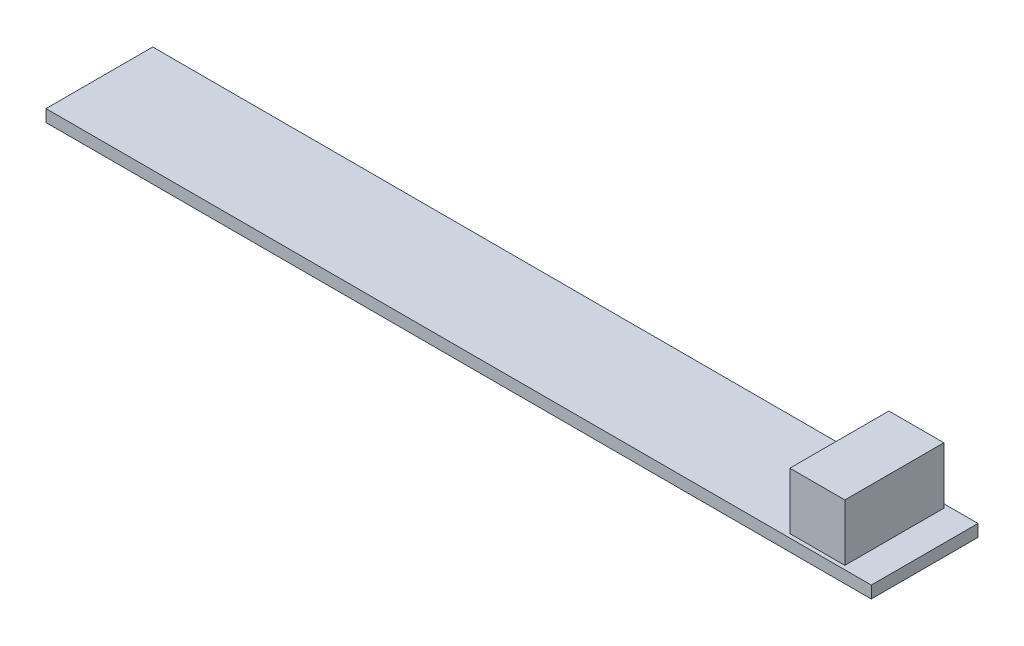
ISO-10303-21;
HEADER;
FILE_DESCRIPTION(('STEP AP214'),'2;1');
FILE_NAME('part.step','',(''),(''),'','','');
FILE_SCHEMA(('AUTOMOTIVE_DESIGN { 1 0 10303 214 1 1 1 1 }'));
ENDSEC;
DATA;
#1=APPLICATION_CONTEXT('core data for automotive mechanical design processes');
#2=APPLICATION_PROTOCOL_DEFINITION('international standard','automotive_design',2000,#1);
#3=PRODUCT_CONTEXT('',#1,'mechanical');
#4=PRODUCT('Part','Part','',(#3));
#5=PRODUCT_RELATED_PRODUCT_CATEGORY('part','',(#4));
#6=PRODUCT_DEFINITION_FORMATION('','',#4);
#7=PRODUCT_DEFINITION_CONTEXT('part definition',#1,'design');
#8=PRODUCT_DEFINITION('design','',#6,#7);
#9=PRODUCT_DEFINITION_SHAPE('','',#8);
#10=(LENGTH_UNIT() NAMED_UNIT(*) SI_UNIT(.MILLI.,.METRE.));
#11=(NAMED_UNIT(*) PLANE_ANGLE_UNIT() SI_UNIT($,.RADIAN.));
#12=(NAMED_UNIT(*) SI_UNIT($,.STERADIAN.) SOLID_ANGLE_UNIT());
#13=UNCERTAINTY_MEASURE_WITH_UNIT(LENGTH_MEASURE(1.E-05),#10,'distance_accuracy_value','');
#14=(GEOMETRIC_REPRESENTATION_CONTEXT(3) GLOBAL_UNCERTAINTY_ASSIGNED_CONTEXT((#13)) GLOBAL_UNIT_ASSIGNED_CONTEXT((#10,
#11,#12)) REPRESENTATION_CONTEXT('',''));
#15=CARTESIAN_POINT('',(0.,0.,0.));
#16=DIRECTION('',(0.,0.,1.));
#17=DIRECTION('',(1.,0.,0.));
#18=AXIS2_PLACEMENT_3D('',#15,#16,#17);
#19=CARTESIAN_POINT('',(0.,1.1176,0.));
#20=DIRECTION('',(0.,-1.,0.));
#21=DIRECTION('',(0.,0.,-1.));
#22=AXIS2_PLACEMENT_3D('',#19,#20,#21);
#23=PLANE('',#22);
#24=DIRECTION('',(0.,0.,1.));
#25=VECTOR('',#24,1.);
#26=CARTESIAN_POINT('',(0.,1.1176,0.));
#27=LINE('',#26,#25);
#28=CARTESIAN_POINT('',(0.,1.1176,-9.8552));
#29=VERTEX_POINT('',#28);
#30=CARTESIAN_POINT('',(0.,1.1176,0.));
#31=VERTEX_POINT('',#30);
#32=EDGE_CURVE('E144',#29,#31,#27,.T.);
#33=ORIENTED_EDGE('',*,*,#32,.T.);
#34=DIRECTION('',(1.,0.,0.));
#35=VECTOR('',#34,1.);
#36=CARTESIAN_POINT('',(0.,1.1176,0.));
#37=LINE('',#36,#35);
#38=CARTESIAN_POINT('',(76.2,1.1176,0.));
#39=VERTEX_POINT('',#38);
#40=EDGE_CURVE('E147',#31,#39,#37,.T.);
#41=ORIENTED_EDGE('',*,*,#40,.T.);
#42=DIRECTION('',(0.,0.,-1.));
#43=VECTOR('',#42,1.);
#44=CARTESIAN_POINT('',(76.2,1.1176,0.));
#45=LINE('',#44,#43);
#46=CARTESIAN_POINT('',(76.2,1.1176,-9.8552));
#47=VERTEX_POINT('',#46);
#48=EDGE_CURVE('E150',#39,#47,#45,.T.);
#49=ORIENTED_EDGE('',*,*,#48,.T.);
#50=DIRECTION('',(-1.,0.,0.));
#51=VECTOR('',#50,1.);
#52=CARTESIAN_POINT('',(0.,1.1176,-9.8552));
#53=LINE('',#52,#51);
#54=EDGE_CURVE('E152',#47,#29,#53,.T.);
#55=ORIENTED_EDGE('',*,*,#54,.T.);
#56=EDGE_LOOP('',(#33,#41,#49,#55));
#57=FACE_BOUND('',#56,.T.);
#58=DIRECTION('',(-1.,0.,0.));
#59=VECTOR('',#58,1.);
#60=CARTESIAN_POINT('',(68.326,1.1176,-9.4996));
#61=LINE('',#60,#59);
#62=CARTESIAN_POINT('',(73.406,1.1176,-9.4996));
#63=VERTEX_POINT('',#62);
#64=CARTESIAN_POINT('',(68.326,1.1176,-9.4996));
#65=VERTEX_POINT('',#64);
#66=EDGE_CURVE('E58',#63,#65,#61,.T.);
#67=ORIENTED_EDGE('',*,*,#66,.F.);
#68=DIRECTION('',(0.,0.,-1.));
#69=VECTOR('',#68,1.);
#70=CARTESIAN_POINT('',(73.406,1.1176,-9.4996));
#71=LINE('',#70,#69);
#72=CARTESIAN_POINT('',(73.406,1.1176,-0.355599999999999));
#73=VERTEX_POINT('',#72);
#74=EDGE_CURVE('E63',#73,#63,#71,.T.);
#75=ORIENTED_EDGE('',*,*,#74,.F.);
#76=DIRECTION('',(1.,0.,0.));
#77=VECTOR('',#76,1.);
#78=CARTESIAN_POINT('',(68.326,1.1176,-0.355599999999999));
#79=LINE('',#78,#77);
#80=CARTESIAN_POINT('',(68.326,1.1176,-0.355599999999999));
#81=VERTEX_POINT('',#80);
#82=EDGE_CURVE('E105',#81,#73,#79,.T.);
#83=ORIENTED_EDGE('',*,*,#82,.F.);
#84=DIRECTION('',(0.,0.,1.));
#85=VECTOR('',#84,1.);
#86=CARTESIAN_POINT('',(68.326,1.1176,-9.4996));
#87=LINE('',#86,#85);
#88=EDGE_CURVE('E108',#65,#81,#87,.T.);
#89=ORIENTED_EDGE('',*,*,#88,.F.);
#90=EDGE_LOOP('',(#67,#75,#83,#89));
#91=FACE_BOUND('',#90,.T.);
#92=ADVANCED_FACE('F41',(#57,#91),#23,.F.);
#93=CARTESIAN_POINT('',(0.,1.1176,0.));
#94=DIRECTION('',(1.,0.,0.));
#95=DIRECTION('',(0.,0.,-1.));
#96=AXIS2_PLACEMENT_3D('',#93,#94,#95);
#97=PLANE('',#96);
#98=DIRECTION('',(0.,0.,1.));
#99=VECTOR('',#98,1.);
#100=CARTESIAN_POINT('',(0.,0.,0.));
#101=LINE('',#100,#99);
#102=CARTESIAN_POINT('',(0.,0.,-9.8552));
#103=VERTEX_POINT('',#102);
#104=CARTESIAN_POINT('',(0.,0.,0.));
#105=VERTEX_POINT('',#104);
#106=EDGE_CURVE('E156',#103,#105,#101,.T.);
#107=ORIENTED_EDGE('',*,*,#106,.T.);
#108=DIRECTION('',(0.,-1.,0.));
#109=VECTOR('',#108,1.);
#110=CARTESIAN_POINT('',(0.,1.1176,0.));
#111=LINE('',#110,#109);
#112=EDGE_CURVE('E12',#31,#105,#111,.T.);
#113=ORIENTED_EDGE('',*,*,#112,.F.);
#114=ORIENTED_EDGE('',*,*,#32,.F.);
#115=DIRECTION('',(0.,-1.,0.));
#116=VECTOR('',#115,1.);
#117=CARTESIAN_POINT('',(0.,1.1176,-9.8552));
#118=LINE('',#117,#116);
#119=EDGE_CURVE('E155',#29,#103,#118,.T.);
#120=ORIENTED_EDGE('',*,*,#119,.T.);
#121=EDGE_LOOP('',(#107,#113,#114,#120));
#122=FACE_BOUND('',#121,.T.);
#123=ADVANCED_FACE('F43',(#122),#97,.F.);
#124=CARTESIAN_POINT('',(0.,1.1176,0.));
#125=DIRECTION('',(0.,0.,-1.));
#126=DIRECTION('',(-1.,0.,0.));
#127=AXIS2_PLACEMENT_3D('',#124,#125,#126);
#128=PLANE('',#127);
#129=DIRECTION('',(1.,0.,0.));
#130=VECTOR('',#129,1.);
#131=CARTESIAN_POINT('',(0.,0.,0.));
#132=LINE('',#131,#130);
#133=CARTESIAN_POINT('',(76.2,0.,0.));
#134=VERTEX_POINT('',#133);
#135=EDGE_CURVE('E159',#105,#134,#132,.T.);
#136=ORIENTED_EDGE('',*,*,#135,.T.);
#137=DIRECTION('',(0.,-1.,0.));
#138=VECTOR('',#137,1.);
#139=CARTESIAN_POINT('',(76.2,1.1176,0.));
#140=LINE('',#139,#138);
#141=EDGE_CURVE('E49',#39,#134,#140,.T.);
#142=ORIENTED_EDGE('',*,*,#141,.F.);
#143=ORIENTED_EDGE('',*,*,#40,.F.);
#144=ORIENTED_EDGE('',*,*,#112,.T.);
#145=EDGE_LOOP('',(#136,#142,#143,#144));
#146=FACE_BOUND('',#145,.T.);
#147=ADVANCED_FACE('F189',(#146),#128,.F.);
#148=CARTESIAN_POINT('',(76.2,1.1176,0.));
#149=DIRECTION('',(-1.,0.,0.));
#150=DIRECTION('',(0.,0.,1.));
#151=AXIS2_PLACEMENT_3D('',#148,#149,#150);
#152=PLANE('',#151);
#153=DIRECTION('',(0.,0.,-1.));
#154=VECTOR('',#153,1.);
#155=CARTESIAN_POINT('',(76.2,0.,0.));
#156=LINE('',#155,#154);
#157=CARTESIAN_POINT('',(76.2,0.,-9.8552));
#158=VERTEX_POINT('',#157);
#159=EDGE_CURVE('E161',#134,#158,#156,.T.);
#160=ORIENTED_EDGE('',*,*,#159,.T.);
#161=DIRECTION('',(0.,-1.,0.));
#162=VECTOR('',#161,1.);
#163=CARTESIAN_POINT('',(76.2,1.1176,-9.8552));
#164=LINE('',#163,#162);
#165=EDGE_CURVE('E167',#47,#158,#164,.T.);
#166=ORIENTED_EDGE('',*,*,#165,.F.);
#167=ORIENTED_EDGE('',*,*,#48,.F.);
#168=ORIENTED_EDGE('',*,*,#141,.T.);
#169=EDGE_LOOP('',(#160,#166,#167,#168));
#170=FACE_BOUND('',#169,.T.);
#171=ADVANCED_FACE('F174',(#170),#152,.F.);
#172=CARTESIAN_POINT('',(0.,1.1176,-9.8552));
#173=DIRECTION('',(0.,0.,1.));
#174=DIRECTION('',(1.,0.,0.));
#175=AXIS2_PLACEMENT_3D('',#172,#173,#174);
#176=PLANE('',#175);
#177=DIRECTION('',(-1.,0.,0.));
#178=VECTOR('',#177,1.);
#179=CARTESIAN_POINT('',(0.,0.,-9.8552));
#180=LINE('',#179,#178);
#181=EDGE_CURVE('E148',#158,#103,#180,.T.);
#182=ORIENTED_EDGE('',*,*,#181,.T.);
#183=ORIENTED_EDGE('',*,*,#119,.F.);
#184=ORIENTED_EDGE('',*,*,#54,.F.);
#185=ORIENTED_EDGE('',*,*,#165,.T.);
#186=EDGE_LOOP('',(#182,#183,#184,#185));
#187=FACE_BOUND('',#186,.T.);
#188=ADVANCED_FACE('F183',(#187),#176,.F.);
#189=CARTESIAN_POINT('',(0.,0.,0.));
#190=DIRECTION('',(0.,-1.,0.));
#191=DIRECTION('',(0.,0.,-1.));
#192=AXIS2_PLACEMENT_3D('',#189,#190,#191);
#193=PLANE('',#192);
#194=ORIENTED_EDGE('',*,*,#106,.F.);
#195=ORIENTED_EDGE('',*,*,#181,.F.);
#196=ORIENTED_EDGE('',*,*,#159,.F.);
#197=ORIENTED_EDGE('',*,*,#135,.F.);
#198=EDGE_LOOP('',(#194,#195,#196,#197));
#199=FACE_BOUND('',#198,.T.);
#200=ADVANCED_FACE('F180',(#199),#193,.T.);
#201=CARTESIAN_POINT('',(68.326,23.1603602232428,-9.4996));
#202=DIRECTION('',(0.,0.,1.));
#203=DIRECTION('',(1.,0.,0.));
#204=AXIS2_PLACEMENT_3D('',#201,#202,#203);
#205=PLANE('',#204);
#206=DIRECTION('',(0.,-1.,0.));
#207=VECTOR('',#206,1.);
#208=CARTESIAN_POINT('',(68.326,23.1603602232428,-9.4996));
#209=LINE('',#208,#207);
#210=CARTESIAN_POINT('',(68.326,6.35,-9.4996));
#211=VERTEX_POINT('',#210);
#212=EDGE_CURVE('E125',#211,#65,#209,.T.);
#213=ORIENTED_EDGE('',*,*,#212,.F.);
#214=DIRECTION('',(1.,0.,0.));
#215=VECTOR('',#214,1.);
#216=CARTESIAN_POINT('',(68.326,6.35,-9.4996));
#217=LINE('',#216,#215);
#218=CARTESIAN_POINT('',(73.406,6.35,-9.4996));
#219=VERTEX_POINT('',#218);
#220=EDGE_CURVE('E120',#211,#219,#217,.T.);
#221=ORIENTED_EDGE('',*,*,#220,.T.);
#222=DIRECTION('',(0.,-1.,0.));
#223=VECTOR('',#222,1.);
#224=CARTESIAN_POINT('',(73.406,23.1603602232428,-9.4996));
#225=LINE('',#224,#223);
#226=EDGE_CURVE('E136',#219,#63,#225,.T.);
#227=ORIENTED_EDGE('',*,*,#226,.T.);
#228=ORIENTED_EDGE('',*,*,#66,.T.);
#229=EDGE_LOOP('',(#213,#221,#227,#228));
#230=FACE_BOUND('',#229,.T.);
#231=ADVANCED_FACE('F205',(#230),#205,.F.);
#232=CARTESIAN_POINT('',(73.406,23.1603602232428,-9.4996));
#233=DIRECTION('',(-1.,0.,0.));
#234=DIRECTION('',(0.,0.,1.));
#235=AXIS2_PLACEMENT_3D('',#232,#233,#234);
#236=PLANE('',#235);
#237=ORIENTED_EDGE('',*,*,#226,.F.);
#238=DIRECTION('',(0.,0.,1.));
#239=VECTOR('',#238,1.);
#240=CARTESIAN_POINT('',(73.406,6.35,-9.4996));
#241=LINE('',#240,#239);
#242=CARTESIAN_POINT('',(73.406,6.35,-0.355599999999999));
#243=VERTEX_POINT('',#242);
#244=EDGE_CURVE('E143',#219,#243,#241,.T.);
#245=ORIENTED_EDGE('',*,*,#244,.T.);
#246=DIRECTION('',(0.,-1.,0.));
#247=VECTOR('',#246,1.);
#248=CARTESIAN_POINT('',(73.406,23.1603602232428,-0.355599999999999));
#249=LINE('',#248,#247);
#250=EDGE_CURVE('E121',#243,#73,#249,.T.);
#251=ORIENTED_EDGE('',*,*,#250,.T.);
#252=ORIENTED_EDGE('',*,*,#74,.T.);
#253=EDGE_LOOP('',(#237,#245,#251,#252));
#254=FACE_BOUND('',#253,.T.);
#255=ADVANCED_FACE('F221',(#254),#236,.F.);
#256=CARTESIAN_POINT('',(68.326,23.1603602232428,-0.355599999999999));
#257=DIRECTION('',(0.,0.,-1.));
#258=DIRECTION('',(-1.,0.,0.));
#259=AXIS2_PLACEMENT_3D('',#256,#257,#258);
#260=PLANE('',#259);
#261=ORIENTED_EDGE('',*,*,#250,.F.);
#262=DIRECTION('',(-1.,0.,0.));
#263=VECTOR('',#262,1.);
#264=CARTESIAN_POINT('',(68.326,6.35,-0.355599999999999));
#265=LINE('',#264,#263);
#266=CARTESIAN_POINT('',(68.326,6.35,-0.355599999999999));
#267=VERTEX_POINT('',#266);
#268=EDGE_CURVE('E117',#243,#267,#265,.T.);
#269=ORIENTED_EDGE('',*,*,#268,.T.);
#270=DIRECTION('',(0.,-1.,0.));
#271=VECTOR('',#270,1.);
#272=CARTESIAN_POINT('',(68.326,23.1603602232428,-0.355599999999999));
#273=LINE('',#272,#271);
#274=EDGE_CURVE('E115',#267,#81,#273,.T.);
#275=ORIENTED_EDGE('',*,*,#274,.T.);
#276=ORIENTED_EDGE('',*,*,#82,.T.);
#277=EDGE_LOOP('',(#261,#269,#275,#276));
#278=FACE_BOUND('',#277,.T.);
#279=ADVANCED_FACE('F116',(#278),#260,.F.);
#280=CARTESIAN_POINT('',(68.326,23.1603602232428,-9.4996));
#281=DIRECTION('',(1.,0.,0.));
#282=DIRECTION('',(0.,0.,-1.));
#283=AXIS2_PLACEMENT_3D('',#280,#281,#282);
#284=PLANE('',#283);
#285=ORIENTED_EDGE('',*,*,#274,.F.);
#286=DIRECTION('',(0.,0.,-1.));
#287=VECTOR('',#286,1.);
#288=CARTESIAN_POINT('',(68.326,6.35,-9.4996));
#289=LINE('',#288,#287);
#290=EDGE_CURVE('E128',#267,#211,#289,.T.);
#291=ORIENTED_EDGE('',*,*,#290,.T.);
#292=ORIENTED_EDGE('',*,*,#212,.T.);
#293=ORIENTED_EDGE('',*,*,#88,.T.);
#294=EDGE_LOOP('',(#285,#291,#292,#293));
#295=FACE_BOUND('',#294,.T.);
#296=ADVANCED_FACE('F123',(#295),#284,.F.);
#297=CARTESIAN_POINT('',(0.,6.35,0.));
#298=DIRECTION('',(0.,-1.,0.));
#299=DIRECTION('',(0.,0.,-1.));
#300=AXIS2_PLACEMENT_3D('',#297,#298,#299);
#301=PLANE('',#300);
#302=ORIENTED_EDGE('',*,*,#268,.F.);
#303=ORIENTED_EDGE('',*,*,#244,.F.);
#304=ORIENTED_EDGE('',*,*,#220,.F.);
#305=ORIENTED_EDGE('',*,*,#290,.F.);
#306=EDGE_LOOP('',(#302,#303,#304,#305));
#307=FACE_BOUND('',#306,.T.);
#308=ADVANCED_FACE('F241',(#307),#301,.F.);
#309=CLOSED_SHELL('',(#92,#123,#147,#171,#188,#200,#231,#255,#279,#296,#308));
#310=MANIFOLD_SOLID_BREP('B2',#309);
#311=ADVANCED_BREP_SHAPE_REPRESENTATION('',(#18,#310),#14);
#312=SHAPE_DEFINITION_REPRESENTATION(#9,#311);
ENDSEC;
END-ISO-10303-21;
